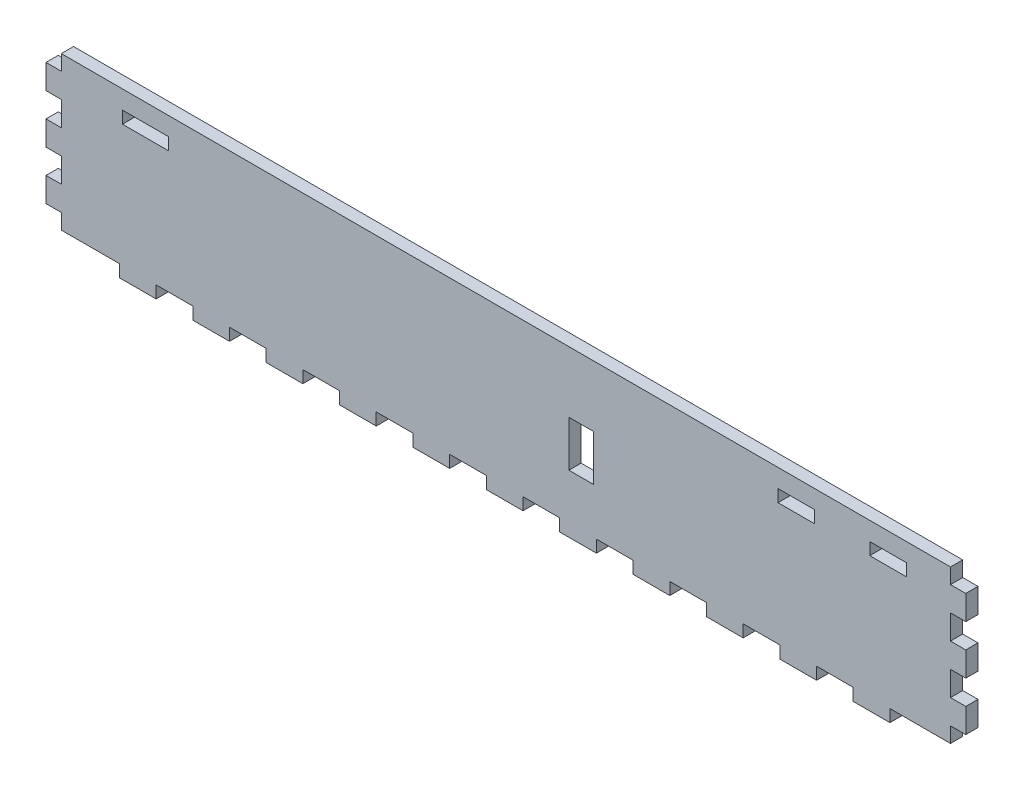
from build123d import *

# Parameters (mm, degrees)
SKETCH1_W           = 12
SKETCH1_H           = 4
SKETCH1_W_2         = 8
SKETCH1_H_2         = 15
SKETCH1_W_3         = 15
BOSS_EXTRUDE1_DEPTH = 4


with BuildPart() as part:
    # Sketch1 → Boss-Extrude1 (new body)
    with BuildSketch(Plane.XY):
        Polygon((145.8, 21), (145.8, 13), (150.8, 13), (150.8, 5), (145.8, 5), (145.8, 0), (126, 0), (126, -4), (114, -4), (114, 0), (102, 0), (102, -4), (90, -4), (90, 0), (78, 0), (78, -4), (66, -4), (66, 0), (54, 0), (54, -4), (42, -4), (42, 0), (30, 0), (30, -4), (18, -4), (18, 0), (6, 0), (6, -4), (-6, -4), (-6, 0), (-18, 0), (-18, -4), (-30, -4), (-30, 0), (-42, 0), (-42, -4), (-54, -4), (-54, 0), (-66, 0), (-66, -4), (-78, -4), (-78, 0), (-90, 0), (-90, -4), (-102, -4), (-102, 0), (-114, 0), (-114, -4), (-126, -4), (-126, 0), (-145, 0), (-145, 5), (-150, 5), (-150, 13), (-145, 13), (-145, 21), (-150, 21), (-150, 29), (-145, 29), (-145, 37), (-150, 37), (-150, 45), (-145, 45), (-145, 50), (145.8, 50), (145.8, 45), (150.8, 45), (150.8, 37), (145.8, 37), (145.8, 29), (150.8, 29), (150.8, 21), align=None)
        with Locations((125.4, 42)):
            Rectangle(SKETCH1_W, SKETCH1_H, mode=Mode.SUBTRACT)
        with Locations((25, 22.5)):
            Rectangle(SKETCH1_W_2, SKETCH1_H_2, mode=Mode.SUBTRACT)
        with Locations((95.4, 42)):
            Rectangle(SKETCH1_W, SKETCH1_H, mode=Mode.SUBTRACT)
        with Locations((-117.5, 42)):
            Rectangle(SKETCH1_W_3, SKETCH1_H, mode=Mode.SUBTRACT)
    extrude(amount=-BOSS_EXTRUDE1_DEPTH)


solid = part.part
